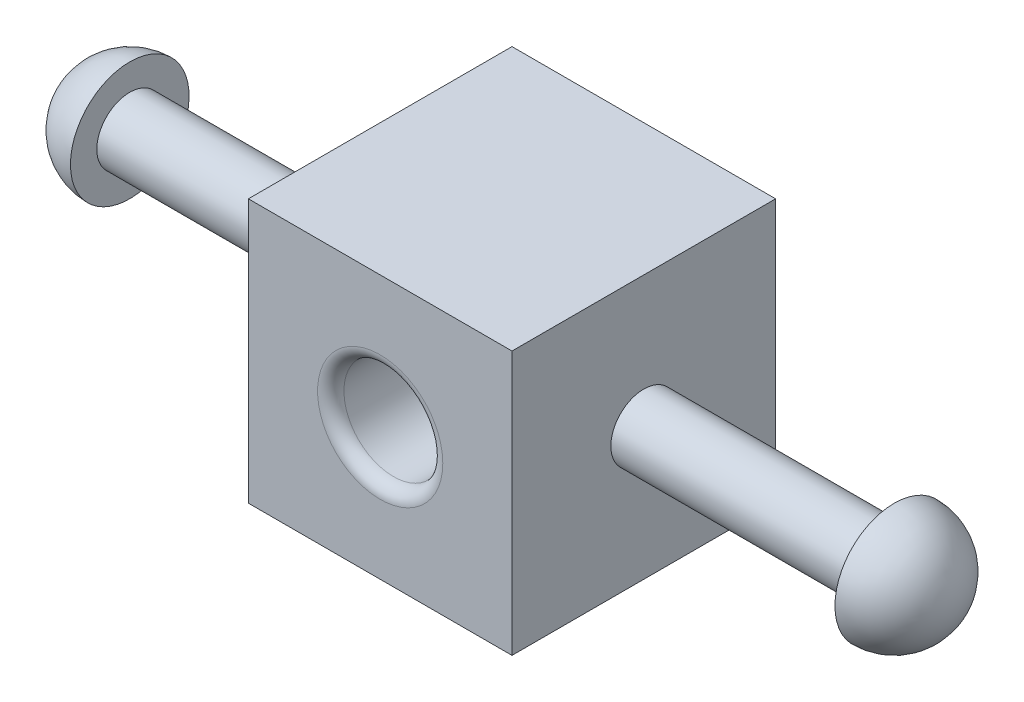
ISO-10303-21;
HEADER;
FILE_DESCRIPTION(('STEP AP214'),'2;1');
FILE_NAME('part.step','',(''),(''),'','','');
FILE_SCHEMA(('AUTOMOTIVE_DESIGN { 1 0 10303 214 1 1 1 1 }'));
ENDSEC;
DATA;
#1=APPLICATION_CONTEXT('core data for automotive mechanical design processes');
#2=APPLICATION_PROTOCOL_DEFINITION('international standard','automotive_design',2000,#1);
#3=PRODUCT_CONTEXT('',#1,'mechanical');
#4=PRODUCT('Part','Part','',(#3));
#5=PRODUCT_RELATED_PRODUCT_CATEGORY('part','',(#4));
#6=PRODUCT_DEFINITION_FORMATION('','',#4);
#7=PRODUCT_DEFINITION_CONTEXT('part definition',#1,'design');
#8=PRODUCT_DEFINITION('design','',#6,#7);
#9=PRODUCT_DEFINITION_SHAPE('','',#8);
#10=(LENGTH_UNIT() NAMED_UNIT(*) SI_UNIT(.MILLI.,.METRE.));
#11=(NAMED_UNIT(*) PLANE_ANGLE_UNIT() SI_UNIT($,.RADIAN.));
#12=(NAMED_UNIT(*) SI_UNIT($,.STERADIAN.) SOLID_ANGLE_UNIT());
#13=UNCERTAINTY_MEASURE_WITH_UNIT(LENGTH_MEASURE(1.E-05),#10,'distance_accuracy_value','');
#14=(GEOMETRIC_REPRESENTATION_CONTEXT(3) GLOBAL_UNCERTAINTY_ASSIGNED_CONTEXT((#13)) GLOBAL_UNIT_ASSIGNED_CONTEXT((#10,
#11,#12)) REPRESENTATION_CONTEXT('',''));
#15=CARTESIAN_POINT('',(0.,0.,0.));
#16=DIRECTION('',(0.,0.,1.));
#17=DIRECTION('',(1.,0.,0.));
#18=AXIS2_PLACEMENT_3D('',#15,#16,#17);
#19=CARTESIAN_POINT('',(-42.545,12.7,0.));
#20=DIRECTION('',(-1.,0.,0.));
#21=DIRECTION('',(0.,0.,1.));
#22=AXIS2_PLACEMENT_3D('',#19,#20,#21);
#23=CYLINDRICAL_SURFACE('',#22,3.17499999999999);
#24=CARTESIAN_POINT('',(4.7625,12.7,3.17499999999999));
#25=CARTESIAN_POINT('',(4.76249829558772,12.5404864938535,3.17499785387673));
#26=CARTESIAN_POINT('',(4.75441585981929,12.3809631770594,3.16291201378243));
#27=CARTESIAN_POINT('',(4.72288699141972,12.0670096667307,3.11531578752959));
#28=CARTESIAN_POINT('',(4.6994332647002,11.9125819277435,3.07979428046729));
#29=CARTESIAN_POINT('',(4.63947623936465,11.6138133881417,2.98750378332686));
#30=CARTESIAN_POINT('',(4.60303407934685,11.4694290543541,2.93083428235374));
#31=CARTESIAN_POINT('',(4.52002748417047,11.1928031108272,2.79866196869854));
#32=CARTESIAN_POINT('',(4.47346157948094,11.0605632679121,2.72315642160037));
#33=CARTESIAN_POINT('',(4.36923384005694,10.7993105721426,2.54848209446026));
#34=CARTESIAN_POINT('',(4.31096574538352,10.6715237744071,2.44784901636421));
#35=CARTESIAN_POINT('',(4.19071922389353,10.4334817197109,2.22927855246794));
#36=CARTESIAN_POINT('',(4.12873555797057,10.3232520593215,2.11131637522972));
#37=CARTESIAN_POINT('',(3.99618620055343,10.1056710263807,1.83982936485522));
#38=CARTESIAN_POINT('',(3.92580920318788,10.0015169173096,1.68363002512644));
#39=CARTESIAN_POINT('',(3.79546083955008,9.82106308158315,1.35197313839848));
#40=CARTESIAN_POINT('',(3.73547157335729,9.74471518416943,1.17654958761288));
#41=CARTESIAN_POINT('',(3.65087323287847,9.64129969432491,0.86247082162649));
#42=CARTESIAN_POINT('',(3.62104984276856,9.60636815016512,0.72782358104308));
#43=CARTESIAN_POINT('',(3.57597026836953,9.55435894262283,0.452843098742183));
#44=CARTESIAN_POINT('',(3.56068897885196,9.53725050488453,0.312520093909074));
#45=CARTESIAN_POINT('',(3.54705611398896,9.52196209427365,0.0294087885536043));
#46=CARTESIAN_POINT('',(3.54877374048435,9.52385949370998,-0.11338722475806));
#47=CARTESIAN_POINT('',(3.56901393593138,9.54662839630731,-0.396295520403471));
#48=CARTESIAN_POINT('',(3.58755074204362,9.56751597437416,-0.53640542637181));
#49=CARTESIAN_POINT('',(3.63739407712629,9.62556821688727,-0.804016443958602));
#50=CARTESIAN_POINT('',(3.66810112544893,9.66197408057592,-0.931801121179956));
#51=CARTESIAN_POINT('',(3.7387152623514,9.7493118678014,-1.17955010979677));
#52=CARTESIAN_POINT('',(3.77862537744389,9.80024857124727,-1.29951183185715));
#53=CARTESIAN_POINT('',(3.87293161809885,9.92705312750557,-1.55420281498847));
#54=CARTESIAN_POINT('',(3.92862304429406,10.0058846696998,-1.68697259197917));
#55=CARTESIAN_POINT('',(4.04322816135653,10.181130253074,-1.93894614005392));
#56=CARTESIAN_POINT('',(4.10214576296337,10.2775659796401,-2.05813288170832));
#57=CARTESIAN_POINT('',(4.23137558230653,10.5095490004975,-2.30591129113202));
#58=CARTESIAN_POINT('',(4.30140657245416,10.6490462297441,-2.43099280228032));
#59=CARTESIAN_POINT('',(4.43258734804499,10.9505623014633,-2.6561994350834));
#60=CARTESIAN_POINT('',(4.493745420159,11.1125598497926,-2.75634790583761));
#61=CARTESIAN_POINT('',(4.59018328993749,11.4222881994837,-2.91064587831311));
#62=CARTESIAN_POINT('',(4.62818577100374,11.566592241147,-2.96996383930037));
#63=CARTESIAN_POINT('',(4.69118503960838,11.8649177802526,-3.06721656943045));
#64=CARTESIAN_POINT('',(4.71619281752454,12.0189309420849,-3.10516941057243));
#65=CARTESIAN_POINT('',(4.75100462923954,12.333310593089,-3.15779334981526));
#66=CARTESIAN_POINT('',(4.76074299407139,12.4937014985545,-3.17236389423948));
#67=CARTESIAN_POINT('',(4.76381945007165,12.8150009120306,-3.1769797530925));
#68=CARTESIAN_POINT('',(4.75715868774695,12.9759093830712,-3.16702678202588));
#69=CARTESIAN_POINT('',(4.72915598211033,13.2817484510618,-3.12479681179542));
#70=CARTESIAN_POINT('',(4.70887816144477,13.4270074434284,-3.0941370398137));
#71=CARTESIAN_POINT('',(4.65643038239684,13.7098347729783,-3.01371684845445));
#72=CARTESIAN_POINT('',(4.62425852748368,13.8474018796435,-2.96395338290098));
#73=CARTESIAN_POINT('',(4.54812959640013,14.1202802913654,-2.84376447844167));
#74=CARTESIAN_POINT('',(4.50357668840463,14.2549501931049,-2.77227005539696));
#75=CARTESIAN_POINT('',(4.40692945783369,14.5108343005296,-2.61233715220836));
#76=CARTESIAN_POINT('',(4.35483048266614,14.6320401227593,-2.52388820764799));
#77=CARTESIAN_POINT('',(4.23790342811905,14.877818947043,-2.31678500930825));
#78=CARTESIAN_POINT('',(4.17236523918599,14.9998936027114,-2.19556606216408));
#79=CARTESIAN_POINT('',(4.04131737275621,15.2230767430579,-1.93498560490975));
#80=CARTESIAN_POINT('',(3.97580774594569,15.3241707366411,-1.79561166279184));
#81=CARTESIAN_POINT('',(3.85666740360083,15.4959808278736,-1.51266141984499));
#82=CARTESIAN_POINT('',(3.80250060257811,15.5685432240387,-1.37043789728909));
#83=CARTESIAN_POINT('',(3.70584371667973,15.6923773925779,-1.0733521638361));
#84=CARTESIAN_POINT('',(3.66333266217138,15.7436874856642,-0.918513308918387));
#85=CARTESIAN_POINT('',(3.60256467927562,15.8152440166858,-0.627753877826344));
#86=CARTESIAN_POINT('',(3.58132059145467,15.8394177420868,-0.49343975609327));
#87=CARTESIAN_POINT('',(3.55408653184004,15.8702248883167,-0.221339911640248));
#88=CARTESIAN_POINT('',(3.54807999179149,15.8768773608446,-0.0835581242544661));
#89=CARTESIAN_POINT('',(3.55225668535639,15.87220478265,0.191520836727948));
#90=CARTESIAN_POINT('',(3.56244950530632,15.8608690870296,0.328817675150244));
#91=CARTESIAN_POINT('',(3.59744096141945,15.8209772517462,0.599032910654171));
#92=CARTESIAN_POINT('',(3.62225908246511,15.792398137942,0.731945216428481));
#93=CARTESIAN_POINT('',(3.69136350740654,15.7097898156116,1.02506622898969));
#94=CARTESIAN_POINT('',(3.73907521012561,15.6510082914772,1.18311132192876));
#95=CARTESIAN_POINT('',(3.84527739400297,15.5112152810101,1.48508652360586));
#96=CARTESIAN_POINT('',(3.90378297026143,15.4301725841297,1.6289964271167));
#97=CARTESIAN_POINT('',(4.02617059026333,15.2463287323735,1.90385549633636));
#98=CARTESIAN_POINT('',(4.09013111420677,15.1431583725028,2.03452106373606));
#99=CARTESIAN_POINT('',(4.21685775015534,14.9172666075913,2.27859138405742));
#100=CARTESIAN_POINT('',(4.27962348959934,14.7945392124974,2.39199082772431));
#101=CARTESIAN_POINT('',(4.37333498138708,14.5873850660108,2.55491858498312));
#102=CARTESIAN_POINT('',(4.40641312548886,14.5090134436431,2.61102761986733));
#103=CARTESIAN_POINT('',(4.46961905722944,14.3466598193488,2.71633779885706));
#104=CARTESIAN_POINT('',(4.49974819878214,14.262680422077,2.76554211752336));
#105=CARTESIAN_POINT('',(4.55616827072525,14.0896071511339,2.85642356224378));
#106=CARTESIAN_POINT('',(4.58246276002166,14.0005181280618,2.89810767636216));
#107=CARTESIAN_POINT('',(4.6304205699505,13.8178296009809,2.97335672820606));
#108=CARTESIAN_POINT('',(4.6520855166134,13.7242316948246,3.00692451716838));
#109=CARTESIAN_POINT('',(4.70058109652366,13.4802353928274,3.08154139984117));
#110=CARTESIAN_POINT('',(4.72362103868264,13.3271040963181,3.11642765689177));
#111=CARTESIAN_POINT('',(4.75457565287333,13.0159825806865,3.16314936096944));
#112=CARTESIAN_POINT('',(4.76250168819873,12.8579961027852,3.17500212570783));
#113=CARTESIAN_POINT('',(4.7625,12.7,3.17499999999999));
#114=B_SPLINE_CURVE_WITH_KNOTS('',3,(#24,#25,#26,#27,#28,#29,#30,#31,#32,#33,#34,#35,#36,#37,
#38,#39,#40,#41,#42,#43,#44,#45,#46,#47,#48,#49,#50,#51,#52,#53,#54,#55,#56,#57,#58,#59,#60,#61,
#62,#63,#64,#65,#66,#67,#68,#69,#70,#71,#72,#73,#74,#75,#76,#77,#78,#79,#80,#81,#82,#83,#84,#85,
#86,#87,#88,#89,#90,#91,#92,#93,#94,#95,#96,#97,#98,#99,#100,#101,#102,#103,#104,#105,#106,#107,
#108,#109,#110,#111,#112,#113),.UNSPECIFIED.,.T.,.F.,(4,2,2,2,2,2,2,2,2,2,2,2,2,2,2,2,2,2,2,2,2,
2,2,2,2,2,2,2,2,2,2,2,2,2,2,2,2,2,2,2,2,2,2,2,4),(0.,0.477921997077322,0.95607094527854,
1.43199826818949,1.90799472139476,2.42438283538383,2.94151703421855,3.54023109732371,
4.13790297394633,4.56300988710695,4.9873815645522,5.41348154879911,5.8399425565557,
6.24758818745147,6.65536806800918,7.14609274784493,7.63742604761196,8.2346634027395,
8.83133933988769,9.31106989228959,9.79039404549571,10.2717740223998,10.7531203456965,
11.200655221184,11.6482614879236,12.1229810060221,12.5979944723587,13.1481222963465,
13.6986288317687,14.2025677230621,14.705593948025,15.1181442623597,15.5302458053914,
15.9425913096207,16.3554874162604,16.8784049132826,17.4020593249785,17.9352455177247,
18.4685953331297,18.7739424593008,19.0791487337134,19.3840699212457,19.6888838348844,
20.1626158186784,20.6359914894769),.UNSPECIFIED.);
#115=CARTESIAN_POINT('',(4.7625,12.7,3.17499999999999));
#116=VERTEX_POINT('',#115);
#117=EDGE_CURVE('E60',#116,#116,#114,.T.);
#118=ORIENTED_EDGE('',*,*,#117,.T.);
#119=EDGE_LOOP('',(#118));
#120=FACE_BOUND('',#119,.T.);
#121=CARTESIAN_POINT('',(36.83,12.7,0.));
#122=DIRECTION('',(-1.,0.,0.));
#123=DIRECTION('',(0.,0.,1.));
#124=AXIS2_PLACEMENT_3D('',#121,#122,#123);
#125=CIRCLE('',#124,3.17499999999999);
#126=CARTESIAN_POINT('',(36.83,12.7,3.17499999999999));
#127=VERTEX_POINT('',#126);
#128=EDGE_CURVE('E53',#127,#127,#125,.T.);
#129=ORIENTED_EDGE('',*,*,#128,.T.);
#130=EDGE_LOOP('',(#129));
#131=FACE_BOUND('',#130,.T.);
#132=ADVANCED_FACE('F48',(#120,#131),#23,.T.);
#133=CARTESIAN_POINT('',(36.83,12.7,0.));
#134=DIRECTION('',(-1.,0.,0.));
#135=DIRECTION('',(0.,1.,0.));
#136=AXIS2_PLACEMENT_3D('',#133,#134,#135);
#137=SPHERICAL_SURFACE('',#136,5.715);
#138=CARTESIAN_POINT('',(36.83,12.7,0.));
#139=DIRECTION('',(-1.,0.,0.));
#140=DIRECTION('',(0.,0.,1.));
#141=AXIS2_PLACEMENT_3D('',#138,#139,#140);
#142=CIRCLE('',#141,5.715);
#143=CARTESIAN_POINT('',(36.83,12.7,5.715));
#144=VERTEX_POINT('',#143);
#145=EDGE_CURVE('E11',#144,#144,#142,.T.);
#146=ORIENTED_EDGE('',*,*,#145,.F.);
#147=EDGE_LOOP('',(#146));
#148=FACE_BOUND('',#147,.T.);
#149=ADVANCED_FACE('F69',(#148),#137,.T.);
#150=CARTESIAN_POINT('',(36.83,15.875,0.));
#151=DIRECTION('',(1.,0.,0.));
#152=DIRECTION('',(0.,0.,-1.));
#153=AXIS2_PLACEMENT_3D('',#150,#151,#152);
#154=PLANE('',#153);
#155=ORIENTED_EDGE('',*,*,#128,.F.);
#156=EDGE_LOOP('',(#155));
#157=FACE_BOUND('',#156,.T.);
#158=ORIENTED_EDGE('',*,*,#145,.T.);
#159=EDGE_LOOP('',(#158));
#160=FACE_BOUND('',#159,.T.);
#161=ADVANCED_FACE('F71',(#157,#160),#154,.F.);
#162=CARTESIAN_POINT('',(0.,12.7,-12.7));
#163=DIRECTION('',(0.,0.,1.));
#164=DIRECTION('',(1.,0.,0.));
#165=AXIS2_PLACEMENT_3D('',#162,#163,#164);
#166=CYLINDRICAL_SURFACE('',#165,4.7625);
#167=ORIENTED_EDGE('',*,*,#117,.F.);
#168=EDGE_LOOP('',(#167));
#169=FACE_BOUND('',#168,.T.);
#170=ADVANCED_FACE('F50',(#169),#166,.F.);
#171=CLOSED_SHELL('',(#132,#149,#161,#170));
#172=MANIFOLD_SOLID_BREP('B2',#171);
#173=CARTESIAN_POINT('',(-12.7,25.4,12.7));
#174=DIRECTION('',(1.,0.,0.));
#175=DIRECTION('',(0.,1.,0.));
#176=AXIS2_PLACEMENT_3D('',#173,#174,#175);
#177=PLANE('',#176);
#178=DIRECTION('',(0.,-1.,0.));
#179=VECTOR('',#178,1.);
#180=CARTESIAN_POINT('',(-12.7,25.4,-12.7));
#181=LINE('',#180,#179);
#182=CARTESIAN_POINT('',(-12.7,25.4,-12.7));
#183=VERTEX_POINT('',#182);
#184=CARTESIAN_POINT('',(-12.7,0.,-12.7));
#185=VERTEX_POINT('',#184);
#186=EDGE_CURVE('E189',#183,#185,#181,.T.);
#187=ORIENTED_EDGE('',*,*,#186,.T.);
#188=DIRECTION('',(0.,0.,-1.));
#189=VECTOR('',#188,1.);
#190=CARTESIAN_POINT('',(-12.7,0.,12.7));
#191=LINE('',#190,#189);
#192=CARTESIAN_POINT('',(-12.7,0.,12.7));
#193=VERTEX_POINT('',#192);
#194=EDGE_CURVE('E178',#193,#185,#191,.T.);
#195=ORIENTED_EDGE('',*,*,#194,.F.);
#196=DIRECTION('',(0.,-1.,0.));
#197=VECTOR('',#196,1.);
#198=CARTESIAN_POINT('',(-12.7,25.4,12.7));
#199=LINE('',#198,#197);
#200=CARTESIAN_POINT('',(-12.7,25.4,12.7));
#201=VERTEX_POINT('',#200);
#202=EDGE_CURVE('E170',#201,#193,#199,.T.);
#203=ORIENTED_EDGE('',*,*,#202,.F.);
#204=DIRECTION('',(0.,0.,-1.));
#205=VECTOR('',#204,1.);
#206=CARTESIAN_POINT('',(-12.7,25.4,12.7));
#207=LINE('',#206,#205);
#208=EDGE_CURVE('E185',#201,#183,#207,.T.);
#209=ORIENTED_EDGE('',*,*,#208,.T.);
#210=EDGE_LOOP('',(#187,#195,#203,#209));
#211=FACE_BOUND('',#210,.T.);
#212=ADVANCED_FACE('F116',(#211),#177,.F.);
#213=CARTESIAN_POINT('',(-12.7,0.,12.7));
#214=DIRECTION('',(0.,1.,0.));
#215=DIRECTION('',(0.,0.,1.));
#216=AXIS2_PLACEMENT_3D('',#213,#214,#215);
#217=PLANE('',#216);
#218=DIRECTION('',(1.,0.,0.));
#219=VECTOR('',#218,1.);
#220=CARTESIAN_POINT('',(-12.7,0.,-12.7));
#221=LINE('',#220,#219);
#222=CARTESIAN_POINT('',(12.7,0.,-12.7));
#223=VERTEX_POINT('',#222);
#224=EDGE_CURVE('E176',#185,#223,#221,.T.);
#225=ORIENTED_EDGE('',*,*,#224,.T.);
#226=DIRECTION('',(0.,0.,-1.));
#227=VECTOR('',#226,1.);
#228=CARTESIAN_POINT('',(12.7,0.,12.7));
#229=LINE('',#228,#227);
#230=CARTESIAN_POINT('',(12.7,0.,12.7));
#231=VERTEX_POINT('',#230);
#232=EDGE_CURVE('E174',#231,#223,#229,.T.);
#233=ORIENTED_EDGE('',*,*,#232,.F.);
#234=DIRECTION('',(1.,0.,0.));
#235=VECTOR('',#234,1.);
#236=CARTESIAN_POINT('',(-12.7,0.,12.7));
#237=LINE('',#236,#235);
#238=EDGE_CURVE('E165',#193,#231,#237,.T.);
#239=ORIENTED_EDGE('',*,*,#238,.F.);
#240=ORIENTED_EDGE('',*,*,#194,.T.);
#241=EDGE_LOOP('',(#225,#233,#239,#240));
#242=FACE_BOUND('',#241,.T.);
#243=ADVANCED_FACE('F175',(#242),#217,.F.);
#244=CARTESIAN_POINT('',(12.7,25.4,12.7));
#245=DIRECTION('',(-1.,0.,0.));
#246=DIRECTION('',(0.,0.,1.));
#247=AXIS2_PLACEMENT_3D('',#244,#245,#246);
#248=PLANE('',#247);
#249=DIRECTION('',(0.,1.,0.));
#250=VECTOR('',#249,1.);
#251=CARTESIAN_POINT('',(12.7,25.4,-12.7));
#252=LINE('',#251,#250);
#253=CARTESIAN_POINT('',(12.7,25.4,-12.7));
#254=VERTEX_POINT('',#253);
#255=EDGE_CURVE('E151',#223,#254,#252,.T.);
#256=ORIENTED_EDGE('',*,*,#255,.T.);
#257=DIRECTION('',(0.,0.,-1.));
#258=VECTOR('',#257,1.);
#259=CARTESIAN_POINT('',(12.7,25.4,12.7));
#260=LINE('',#259,#258);
#261=CARTESIAN_POINT('',(12.7,25.4,12.7));
#262=VERTEX_POINT('',#261);
#263=EDGE_CURVE('E179',#262,#254,#260,.T.);
#264=ORIENTED_EDGE('',*,*,#263,.F.);
#265=DIRECTION('',(0.,1.,0.));
#266=VECTOR('',#265,1.);
#267=CARTESIAN_POINT('',(12.7,25.4,12.7));
#268=LINE('',#267,#266);
#269=EDGE_CURVE('E168',#231,#262,#268,.T.);
#270=ORIENTED_EDGE('',*,*,#269,.F.);
#271=ORIENTED_EDGE('',*,*,#232,.T.);
#272=EDGE_LOOP('',(#256,#264,#270,#271));
#273=FACE_BOUND('',#272,.T.);
#274=ADVANCED_FACE('F181',(#273),#248,.F.);
#275=CARTESIAN_POINT('',(-12.7,25.4,12.7));
#276=DIRECTION('',(0.,-1.,0.));
#277=DIRECTION('',(1.,0.,0.));
#278=AXIS2_PLACEMENT_3D('',#275,#276,#277);
#279=PLANE('',#278);
#280=DIRECTION('',(-1.,0.,0.));
#281=VECTOR('',#280,1.);
#282=CARTESIAN_POINT('',(-12.7,25.4,-12.7));
#283=LINE('',#282,#281);
#284=EDGE_CURVE('E157',#254,#183,#283,.T.);
#285=ORIENTED_EDGE('',*,*,#284,.T.);
#286=ORIENTED_EDGE('',*,*,#208,.F.);
#287=DIRECTION('',(-1.,0.,0.));
#288=VECTOR('',#287,1.);
#289=CARTESIAN_POINT('',(-12.7,25.4,12.7));
#290=LINE('',#289,#288);
#291=EDGE_CURVE('E134',#262,#201,#290,.T.);
#292=ORIENTED_EDGE('',*,*,#291,.F.);
#293=ORIENTED_EDGE('',*,*,#263,.T.);
#294=EDGE_LOOP('',(#285,#286,#292,#293));
#295=FACE_BOUND('',#294,.T.);
#296=ADVANCED_FACE('F238',(#295),#279,.F.);
#297=CARTESIAN_POINT('',(0.,0.,12.7));
#298=DIRECTION('',(0.,0.,1.));
#299=DIRECTION('',(1.,0.,0.));
#300=AXIS2_PLACEMENT_3D('',#297,#298,#299);
#301=PLANE('',#300);
#302=CARTESIAN_POINT('',(0.,12.7,12.7));
#303=DIRECTION('',(0.,0.,1.));
#304=DIRECTION('',(1.,0.,0.));
#305=AXIS2_PLACEMENT_3D('',#302,#303,#304);
#306=CIRCLE('',#305,6.0325);
#307=CARTESIAN_POINT('',(6.0325,12.7,12.7));
#308=VERTEX_POINT('',#307);
#309=EDGE_CURVE('E209',#308,#308,#306,.F.);
#310=ORIENTED_EDGE('',*,*,#309,.T.);
#311=EDGE_LOOP('',(#310));
#312=FACE_BOUND('',#311,.T.);
#313=ORIENTED_EDGE('',*,*,#202,.T.);
#314=ORIENTED_EDGE('',*,*,#238,.T.);
#315=ORIENTED_EDGE('',*,*,#269,.T.);
#316=ORIENTED_EDGE('',*,*,#291,.T.);
#317=EDGE_LOOP('',(#313,#314,#315,#316));
#318=FACE_BOUND('',#317,.T.);
#319=ADVANCED_FACE('F166',(#312,#318),#301,.T.);
#320=CARTESIAN_POINT('',(0.,0.,-12.7));
#321=DIRECTION('',(0.,0.,1.));
#322=DIRECTION('',(1.,0.,0.));
#323=AXIS2_PLACEMENT_3D('',#320,#321,#322);
#324=PLANE('',#323);
#325=CARTESIAN_POINT('',(0.,12.7,-12.7));
#326=DIRECTION('',(0.,0.,1.));
#327=DIRECTION('',(1.,0.,0.));
#328=AXIS2_PLACEMENT_3D('',#325,#326,#327);
#329=CIRCLE('',#328,6.0325);
#330=CARTESIAN_POINT('',(6.0325,12.7,-12.7));
#331=VERTEX_POINT('',#330);
#332=EDGE_CURVE('E126',#331,#331,#329,.T.);
#333=ORIENTED_EDGE('',*,*,#332,.T.);
#334=EDGE_LOOP('',(#333));
#335=FACE_BOUND('',#334,.T.);
#336=ORIENTED_EDGE('',*,*,#186,.F.);
#337=ORIENTED_EDGE('',*,*,#284,.F.);
#338=ORIENTED_EDGE('',*,*,#255,.F.);
#339=ORIENTED_EDGE('',*,*,#224,.F.);
#340=EDGE_LOOP('',(#336,#337,#338,#339));
#341=FACE_BOUND('',#340,.T.);
#342=ADVANCED_FACE('F216',(#335,#341),#324,.F.);
#343=CARTESIAN_POINT('',(0.,12.7,-12.7));
#344=DIRECTION('',(0.,0.,1.));
#345=DIRECTION('',(1.,0.,0.));
#346=AXIS2_PLACEMENT_3D('',#343,#344,#345);
#347=CYLINDRICAL_SURFACE('',#346,4.7625);
#348=CARTESIAN_POINT('',(0.,12.7,-11.43));
#349=DIRECTION('',(0.,0.,1.));
#350=DIRECTION('',(1.,0.,0.));
#351=AXIS2_PLACEMENT_3D('',#348,#349,#350);
#352=CIRCLE('',#351,4.7625);
#353=CARTESIAN_POINT('',(4.7625,12.7,-11.43));
#354=VERTEX_POINT('',#353);
#355=EDGE_CURVE('E46',#354,#354,#352,.F.);
#356=ORIENTED_EDGE('',*,*,#355,.T.);
#357=EDGE_LOOP('',(#356));
#358=FACE_BOUND('',#357,.T.);
#359=CARTESIAN_POINT('',(0.,12.7,11.43));
#360=DIRECTION('',(0.,0.,1.));
#361=DIRECTION('',(1.,0.,0.));
#362=AXIS2_PLACEMENT_3D('',#359,#360,#361);
#363=CIRCLE('',#362,4.7625);
#364=CARTESIAN_POINT('',(4.7625,12.7,11.43));
#365=VERTEX_POINT('',#364);
#366=EDGE_CURVE('E205',#365,#365,#363,.T.);
#367=ORIENTED_EDGE('',*,*,#366,.T.);
#368=EDGE_LOOP('',(#367));
#369=FACE_BOUND('',#368,.T.);
#370=ADVANCED_FACE('F225',(#358,#369),#347,.F.);
#371=CARTESIAN_POINT('',(0.,12.7,11.43));
#372=DIRECTION('',(0.,0.,1.));
#373=DIRECTION('',(1.,0.,0.));
#374=AXIS2_PLACEMENT_3D('',#371,#372,#373);
#375=TOROIDAL_SURFACE('',#374,6.0325,1.27);
#376=ORIENTED_EDGE('',*,*,#309,.F.);
#377=EDGE_LOOP('',(#376));
#378=FACE_BOUND('',#377,.T.);
#379=ORIENTED_EDGE('',*,*,#366,.F.);
#380=EDGE_LOOP('',(#379));
#381=FACE_BOUND('',#380,.T.);
#382=ADVANCED_FACE('F220',(#378,#381),#375,.T.);
#383=CARTESIAN_POINT('',(0.,12.7,-11.43));
#384=DIRECTION('',(0.,0.,1.));
#385=DIRECTION('',(1.,0.,0.));
#386=AXIS2_PLACEMENT_3D('',#383,#384,#385);
#387=TOROIDAL_SURFACE('',#386,6.0325,1.27);
#388=ORIENTED_EDGE('',*,*,#355,.F.);
#389=EDGE_LOOP('',(#388));
#390=FACE_BOUND('',#389,.T.);
#391=ORIENTED_EDGE('',*,*,#332,.F.);
#392=EDGE_LOOP('',(#391));
#393=FACE_BOUND('',#392,.T.);
#394=ADVANCED_FACE('F118',(#390,#393),#387,.T.);
#395=CLOSED_SHELL('',(#212,#243,#274,#296,#319,#342,#370,#382,#394));
#396=MANIFOLD_SOLID_BREP('B6',#395);
#397=CARTESIAN_POINT('',(-36.83,12.7,0.));
#398=DIRECTION('',(-1.,0.,0.));
#399=DIRECTION('',(0.,1.,0.));
#400=AXIS2_PLACEMENT_3D('',#397,#398,#399);
#401=SPHERICAL_SURFACE('',#400,5.715);
#402=CARTESIAN_POINT('',(-36.83,12.7,0.));
#403=DIRECTION('',(-1.,0.,0.));
#404=DIRECTION('',(0.,0.,1.));
#405=AXIS2_PLACEMENT_3D('',#402,#403,#404);
#406=CIRCLE('',#405,5.715);
#407=CARTESIAN_POINT('',(-36.83,12.7,5.715));
#408=VERTEX_POINT('',#407);
#409=EDGE_CURVE('E115',#408,#408,#406,.T.);
#410=ORIENTED_EDGE('',*,*,#409,.T.);
#411=EDGE_LOOP('',(#410));
#412=FACE_BOUND('',#411,.T.);
#413=ADVANCED_FACE('F307',(#412),#401,.T.);
#414=CARTESIAN_POINT('',(-36.83,15.875,0.));
#415=DIRECTION('',(-1.,0.,0.));
#416=DIRECTION('',(0.,0.,1.));
#417=AXIS2_PLACEMENT_3D('',#414,#415,#416);
#418=PLANE('',#417);
#419=ORIENTED_EDGE('',*,*,#409,.F.);
#420=EDGE_LOOP('',(#419));
#421=FACE_BOUND('',#420,.T.);
#422=CARTESIAN_POINT('',(-36.83,12.7,0.));
#423=DIRECTION('',(-1.,0.,0.));
#424=DIRECTION('',(0.,0.,1.));
#425=AXIS2_PLACEMENT_3D('',#422,#423,#424);
#426=CIRCLE('',#425,3.17499999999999);
#427=CARTESIAN_POINT('',(-36.83,12.7,3.17499999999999));
#428=VERTEX_POINT('',#427);
#429=EDGE_CURVE('E320',#428,#428,#426,.T.);
#430=ORIENTED_EDGE('',*,*,#429,.T.);
#431=EDGE_LOOP('',(#430));
#432=FACE_BOUND('',#431,.T.);
#433=ADVANCED_FACE('F309',(#421,#432),#418,.F.);
#434=CARTESIAN_POINT('',(-42.545,12.7,0.));
#435=DIRECTION('',(-1.,0.,0.));
#436=DIRECTION('',(0.,0.,1.));
#437=AXIS2_PLACEMENT_3D('',#434,#435,#436);
#438=CYLINDRICAL_SURFACE('',#437,3.17499999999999);
#439=CARTESIAN_POINT('',(-4.7625,12.7,3.17499999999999));
#440=CARTESIAN_POINT('',(-4.76249829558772,12.8595135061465,3.17499785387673));
#441=CARTESIAN_POINT('',(-4.75441585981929,13.0190368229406,3.16291201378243));
#442=CARTESIAN_POINT('',(-4.72288699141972,13.3329903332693,3.11531578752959));
#443=CARTESIAN_POINT('',(-4.6994332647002,13.4874180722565,3.07979428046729));
#444=CARTESIAN_POINT('',(-4.63947623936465,13.7861866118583,2.98750378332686));
#445=CARTESIAN_POINT('',(-4.60303407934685,13.9305709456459,2.93083428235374));
#446=CARTESIAN_POINT('',(-4.52002748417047,14.2071968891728,2.79866196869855));
#447=CARTESIAN_POINT('',(-4.47346157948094,14.3394367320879,2.72315642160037));
#448=CARTESIAN_POINT('',(-4.36923384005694,14.6006894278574,2.54848209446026));
#449=CARTESIAN_POINT('',(-4.31096574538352,14.7284762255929,2.44784901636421));
#450=CARTESIAN_POINT('',(-4.19071922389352,14.9665182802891,2.22927855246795));
#451=CARTESIAN_POINT('',(-4.12873555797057,15.0767479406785,2.11131637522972));
#452=CARTESIAN_POINT('',(-3.99618620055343,15.2943289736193,1.83982936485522));
#453=CARTESIAN_POINT('',(-3.92580920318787,15.3984830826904,1.68363002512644));
#454=CARTESIAN_POINT('',(-3.79546083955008,15.5789369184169,1.35197313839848));
#455=CARTESIAN_POINT('',(-3.73547157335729,15.6552848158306,1.17654958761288));
#456=CARTESIAN_POINT('',(-3.65087323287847,15.7587003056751,0.86247082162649));
#457=CARTESIAN_POINT('',(-3.62104984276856,15.7936318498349,0.72782358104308));
#458=CARTESIAN_POINT('',(-3.57597026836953,15.8456410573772,0.452843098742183));
#459=CARTESIAN_POINT('',(-3.56068897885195,15.8627494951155,0.312520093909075));
#460=CARTESIAN_POINT('',(-3.54705611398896,15.8780379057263,0.0294087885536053));
#461=CARTESIAN_POINT('',(-3.54877374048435,15.87614050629,-0.113387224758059));
#462=CARTESIAN_POINT('',(-3.56901393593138,15.8533716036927,-0.39629552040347));
#463=CARTESIAN_POINT('',(-3.58755074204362,15.8324840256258,-0.536405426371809));
#464=CARTESIAN_POINT('',(-3.63739407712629,15.7744317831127,-0.804016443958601));
#465=CARTESIAN_POINT('',(-3.66810112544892,15.7380259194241,-0.931801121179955));
#466=CARTESIAN_POINT('',(-3.73871526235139,15.6506881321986,-1.17955010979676));
#467=CARTESIAN_POINT('',(-3.77862537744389,15.5997514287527,-1.29951183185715));
#468=CARTESIAN_POINT('',(-3.87293161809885,15.4729468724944,-1.55420281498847));
#469=CARTESIAN_POINT('',(-3.92862304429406,15.3941153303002,-1.68697259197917));
#470=CARTESIAN_POINT('',(-4.04322816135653,15.218869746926,-1.93894614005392));
#471=CARTESIAN_POINT('',(-4.10214576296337,15.1224340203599,-2.05813288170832));
#472=CARTESIAN_POINT('',(-4.23137558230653,14.8904509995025,-2.30591129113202));
#473=CARTESIAN_POINT('',(-4.30140657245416,14.7509537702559,-2.43099280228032));
#474=CARTESIAN_POINT('',(-4.43258734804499,14.4494376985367,-2.6561994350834));
#475=CARTESIAN_POINT('',(-4.493745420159,14.2874401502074,-2.75634790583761));
#476=CARTESIAN_POINT('',(-4.59018328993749,13.9777118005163,-2.91064587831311));
#477=CARTESIAN_POINT('',(-4.62818577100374,13.833407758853,-2.96996383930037));
#478=CARTESIAN_POINT('',(-4.69118503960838,13.5350822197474,-3.06721656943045));
#479=CARTESIAN_POINT('',(-4.71619281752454,13.3810690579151,-3.10516941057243));
#480=CARTESIAN_POINT('',(-4.75100462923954,13.066689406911,-3.15779334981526));
#481=CARTESIAN_POINT('',(-4.76074299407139,12.9062985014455,-3.17236389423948));
#482=CARTESIAN_POINT('',(-4.76381945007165,12.5849990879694,-3.1769797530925));
#483=CARTESIAN_POINT('',(-4.75715868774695,12.4240906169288,-3.16702678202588));
#484=CARTESIAN_POINT('',(-4.72915598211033,12.1182515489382,-3.12479681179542));
#485=CARTESIAN_POINT('',(-4.70887816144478,11.9729925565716,-3.0941370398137));
#486=CARTESIAN_POINT('',(-4.65643038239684,11.6901652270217,-3.01371684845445));
#487=CARTESIAN_POINT('',(-4.62425852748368,11.5525981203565,-2.96395338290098));
#488=CARTESIAN_POINT('',(-4.54812959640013,11.2797197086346,-2.84376447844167));
#489=CARTESIAN_POINT('',(-4.50357668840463,11.1450498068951,-2.77227005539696));
#490=CARTESIAN_POINT('',(-4.40692945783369,10.8891656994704,-2.61233715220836));
#491=CARTESIAN_POINT('',(-4.35483048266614,10.7679598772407,-2.52388820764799));
#492=CARTESIAN_POINT('',(-4.23790342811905,10.522181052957,-2.31678500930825));
#493=CARTESIAN_POINT('',(-4.17236523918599,10.4001063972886,-2.19556606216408));
#494=CARTESIAN_POINT('',(-4.04131737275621,10.1769232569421,-1.93498560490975));
#495=CARTESIAN_POINT('',(-3.97580774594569,10.0758292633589,-1.79561166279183));
#496=CARTESIAN_POINT('',(-3.85666740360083,9.90401917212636,-1.51266141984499));
#497=CARTESIAN_POINT('',(-3.80250060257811,9.83145677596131,-1.37043789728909));
#498=CARTESIAN_POINT('',(-3.70584371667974,9.70762260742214,-1.0733521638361));
#499=CARTESIAN_POINT('',(-3.66333266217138,9.65631251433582,-0.918513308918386));
#500=CARTESIAN_POINT('',(-3.60256467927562,9.58475598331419,-0.627753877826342));
#501=CARTESIAN_POINT('',(-3.58132059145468,9.56058225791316,-0.493439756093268));
#502=CARTESIAN_POINT('',(-3.55408653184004,9.52977511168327,-0.221339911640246));
#503=CARTESIAN_POINT('',(-3.54807999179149,9.52312263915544,-0.0835581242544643));
#504=CARTESIAN_POINT('',(-3.55225668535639,9.52779521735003,0.19152083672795));
#505=CARTESIAN_POINT('',(-3.56244950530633,9.5391309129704,0.328817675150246));
#506=CARTESIAN_POINT('',(-3.59744096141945,9.57902274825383,0.599032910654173));
#507=CARTESIAN_POINT('',(-3.62225908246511,9.60760186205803,0.731945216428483));
#508=CARTESIAN_POINT('',(-3.69136350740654,9.69021018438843,1.02506622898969));
#509=CARTESIAN_POINT('',(-3.73907521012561,9.74899170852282,1.18311132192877));
#510=CARTESIAN_POINT('',(-3.84527739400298,9.88878471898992,1.48508652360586));
#511=CARTESIAN_POINT('',(-3.90378297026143,9.96982741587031,1.62899642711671));
#512=CARTESIAN_POINT('',(-4.02617059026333,10.1536712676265,1.90385549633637));
#513=CARTESIAN_POINT('',(-4.09013111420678,10.2568416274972,2.03452106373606));
#514=CARTESIAN_POINT('',(-4.21685775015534,10.4827333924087,2.27859138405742));
#515=CARTESIAN_POINT('',(-4.27962348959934,10.6054607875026,2.39199082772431));
#516=CARTESIAN_POINT('',(-4.37333498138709,10.8126149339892,2.55491858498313));
#517=CARTESIAN_POINT('',(-4.40641312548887,10.8909865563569,2.61102761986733));
#518=CARTESIAN_POINT('',(-4.46961905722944,11.0533401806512,2.71633779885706));
#519=CARTESIAN_POINT('',(-4.49974819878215,11.137319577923,2.76554211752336));
#520=CARTESIAN_POINT('',(-4.55616827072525,11.3103928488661,2.85642356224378));
#521=CARTESIAN_POINT('',(-4.58246276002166,11.3994818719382,2.89810767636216));
#522=CARTESIAN_POINT('',(-4.6304205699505,11.5821703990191,2.97335672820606));
#523=CARTESIAN_POINT('',(-4.6520855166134,11.6757683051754,3.00692451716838));
#524=CARTESIAN_POINT('',(-4.70058109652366,11.9197646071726,3.08154139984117));
#525=CARTESIAN_POINT('',(-4.72362103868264,12.0728959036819,3.11642765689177));
#526=CARTESIAN_POINT('',(-4.75457565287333,12.3840174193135,3.16314936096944));
#527=CARTESIAN_POINT('',(-4.76250168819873,12.5420038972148,3.17500212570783));
#528=CARTESIAN_POINT('',(-4.7625,12.7,3.17499999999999));
#529=B_SPLINE_CURVE_WITH_KNOTS('',3,(#439,#440,#441,#442,#443,#444,#445,#446,#447,#448,#449,
#450,#451,#452,#453,#454,#455,#456,#457,#458,#459,#460,#461,#462,#463,#464,#465,#466,#467,#468,
#469,#470,#471,#472,#473,#474,#475,#476,#477,#478,#479,#480,#481,#482,#483,#484,#485,#486,#487,
#488,#489,#490,#491,#492,#493,#494,#495,#496,#497,#498,#499,#500,#501,#502,#503,#504,#505,#506,
#507,#508,#509,#510,#511,#512,#513,#514,#515,#516,#517,#518,#519,#520,#521,#522,#523,#524,#525,
#526,#527,#528),.UNSPECIFIED.,.T.,.F.,(4,2,2,2,2,2,2,2,2,2,2,2,2,2,2,2,2,2,2,2,2,2,2,2,2,2,2,2,
2,2,2,2,2,2,2,2,2,2,2,2,2,2,2,2,4),(0.,0.477921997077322,0.95607094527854,1.43199826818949,
1.90799472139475,2.42438283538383,2.94151703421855,3.54023109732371,4.13790297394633,
4.56300988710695,4.9873815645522,5.41348154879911,5.8399425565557,6.24758818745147,
6.65536806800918,7.14609274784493,7.63742604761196,8.2346634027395,8.83133933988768,
9.31106989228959,9.79039404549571,10.2717740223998,10.7531203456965,11.200655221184,
11.6482614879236,12.1229810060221,12.5979944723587,13.1481222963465,13.6986288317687,
14.2025677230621,14.705593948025,15.1181442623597,15.5302458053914,15.9425913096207,
16.3554874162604,16.8784049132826,17.4020593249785,17.9352455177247,18.4685953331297,
18.7739424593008,19.0791487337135,19.3840699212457,19.6888838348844,20.1626158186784,
20.6359914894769),.UNSPECIFIED.);
#530=CARTESIAN_POINT('',(-4.7625,12.7,3.17499999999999));
#531=VERTEX_POINT('',#530);
#532=EDGE_CURVE('E311',#531,#531,#529,.T.);
#533=ORIENTED_EDGE('',*,*,#532,.T.);
#534=EDGE_LOOP('',(#533));
#535=FACE_BOUND('',#534,.T.);
#536=ORIENTED_EDGE('',*,*,#429,.F.);
#537=EDGE_LOOP('',(#536));
#538=FACE_BOUND('',#537,.T.);
#539=ADVANCED_FACE('F330',(#535,#538),#438,.T.);
#540=CARTESIAN_POINT('',(0.,12.7,-12.7));
#541=DIRECTION('',(0.,0.,1.));
#542=DIRECTION('',(1.,0.,0.));
#543=AXIS2_PLACEMENT_3D('',#540,#541,#542);
#544=CYLINDRICAL_SURFACE('',#543,4.7625);
#545=ORIENTED_EDGE('',*,*,#532,.F.);
#546=EDGE_LOOP('',(#545));
#547=FACE_BOUND('',#546,.T.);
#548=ADVANCED_FACE('F333',(#547),#544,.F.);
#549=CLOSED_SHELL('',(#413,#433,#539,#548));
#550=MANIFOLD_SOLID_BREP('B40',#549);
#551=ADVANCED_BREP_SHAPE_REPRESENTATION('',(#18,#172,#396,#550),#14);
#552=SHAPE_DEFINITION_REPRESENTATION(#9,#551);
ENDSEC;
END-ISO-10303-21;
